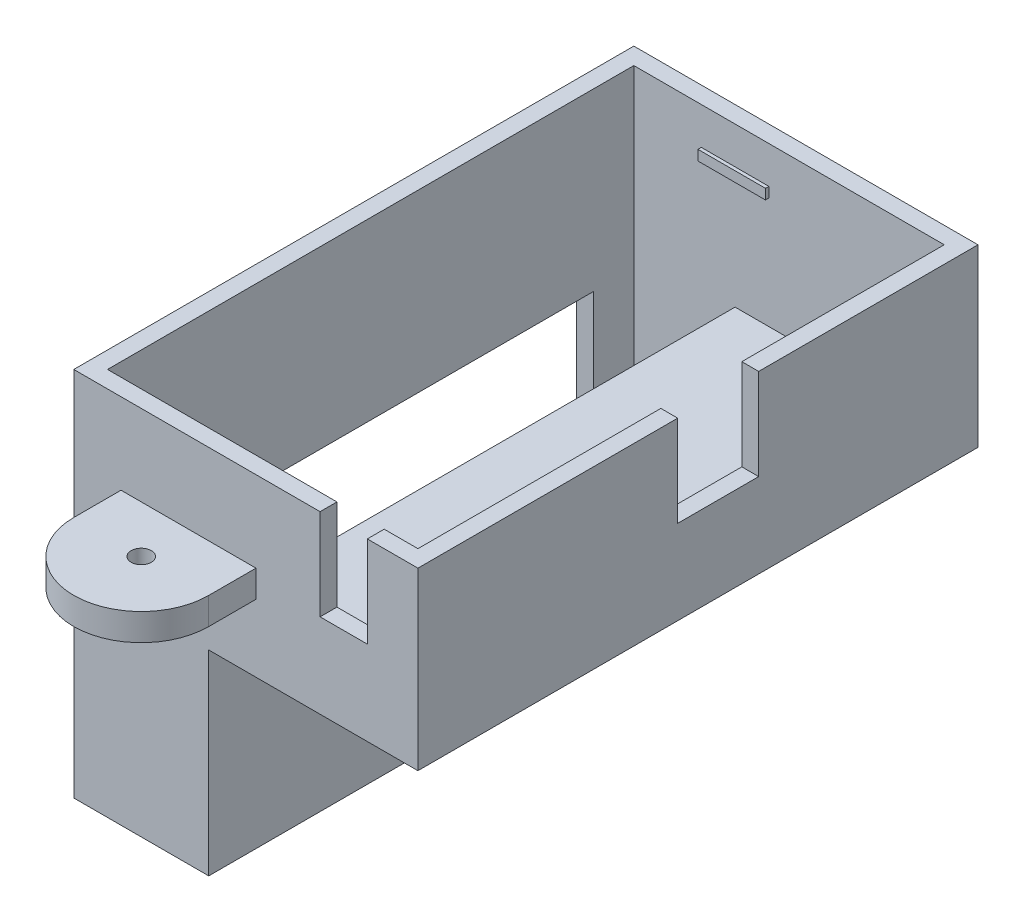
ISO-10303-21;
HEADER;
FILE_DESCRIPTION(('STEP AP214'),'2;1');
FILE_NAME('part.step','',(''),(''),'','','');
FILE_SCHEMA(('AUTOMOTIVE_DESIGN { 1 0 10303 214 1 1 1 1 }'));
ENDSEC;
DATA;
#1=APPLICATION_CONTEXT('core data for automotive mechanical design processes');
#2=APPLICATION_PROTOCOL_DEFINITION('international standard','automotive_design',2000,#1);
#3=PRODUCT_CONTEXT('',#1,'mechanical');
#4=PRODUCT('Part','Part','',(#3));
#5=PRODUCT_RELATED_PRODUCT_CATEGORY('part','',(#4));
#6=PRODUCT_DEFINITION_FORMATION('','',#4);
#7=PRODUCT_DEFINITION_CONTEXT('part definition',#1,'design');
#8=PRODUCT_DEFINITION('design','',#6,#7);
#9=PRODUCT_DEFINITION_SHAPE('','',#8);
#10=(LENGTH_UNIT() NAMED_UNIT(*) SI_UNIT(.MILLI.,.METRE.));
#11=(NAMED_UNIT(*) PLANE_ANGLE_UNIT() SI_UNIT($,.RADIAN.));
#12=(NAMED_UNIT(*) SI_UNIT($,.STERADIAN.) SOLID_ANGLE_UNIT());
#13=UNCERTAINTY_MEASURE_WITH_UNIT(LENGTH_MEASURE(1.E-05),#10,'distance_accuracy_value','');
#14=(GEOMETRIC_REPRESENTATION_CONTEXT(3) GLOBAL_UNCERTAINTY_ASSIGNED_CONTEXT((#13)) GLOBAL_UNIT_ASSIGNED_CONTEXT((#10,
#11,#12)) REPRESENTATION_CONTEXT('',''));
#15=CARTESIAN_POINT('',(0.,0.,0.));
#16=DIRECTION('',(0.,0.,1.));
#17=DIRECTION('',(1.,0.,0.));
#18=AXIS2_PLACEMENT_3D('',#15,#16,#17);
#19=CARTESIAN_POINT('',(-25.5,55.,41.5));
#20=DIRECTION('',(0.,0.,-1.));
#21=DIRECTION('',(-1.,0.,0.));
#22=AXIS2_PLACEMENT_3D('',#19,#20,#21);
#23=PLANE('',#22);
#24=DIRECTION('',(0.,-1.,0.));
#25=VECTOR('',#24,1.);
#26=CARTESIAN_POINT('',(11.,41.5,41.5));
#27=LINE('',#26,#25);
#28=CARTESIAN_POINT('',(11.,55.,41.5));
#29=VERTEX_POINT('',#28);
#30=CARTESIAN_POINT('',(11.,41.5,41.5));
#31=VERTEX_POINT('',#30);
#32=EDGE_CURVE('E390',#29,#31,#27,.T.);
#33=ORIENTED_EDGE('',*,*,#32,.F.);
#34=DIRECTION('',(1.,0.,0.));
#35=VECTOR('',#34,1.);
#36=CARTESIAN_POINT('',(-25.5,55.,41.5));
#37=LINE('',#36,#35);
#38=CARTESIAN_POINT('',(-25.5,55.,41.5));
#39=VERTEX_POINT('',#38);
#40=EDGE_CURVE('E511',#39,#29,#37,.T.);
#41=ORIENTED_EDGE('',*,*,#40,.F.);
#42=DIRECTION('',(0.,-1.,0.));
#43=VECTOR('',#42,1.);
#44=CARTESIAN_POINT('',(-25.5,55.,41.5));
#45=LINE('',#44,#43);
#46=CARTESIAN_POINT('',(-25.5,0.,41.5));
#47=VERTEX_POINT('',#46);
#48=EDGE_CURVE('E12',#39,#47,#45,.T.);
#49=ORIENTED_EDGE('',*,*,#48,.T.);
#50=DIRECTION('',(1.,0.,0.));
#51=VECTOR('',#50,1.);
#52=CARTESIAN_POINT('',(-25.5,0.,41.5));
#53=LINE('',#52,#51);
#54=CARTESIAN_POINT('',(-5.49999999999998,0.,41.5));
#55=VERTEX_POINT('',#54);
#56=EDGE_CURVE('E522',#47,#55,#53,.T.);
#57=ORIENTED_EDGE('',*,*,#56,.T.);
#58=DIRECTION('',(0.,-1.,0.));
#59=VECTOR('',#58,1.);
#60=CARTESIAN_POINT('',(-5.49999999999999,120.100225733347,41.5));
#61=LINE('',#60,#59);
#62=CARTESIAN_POINT('',(-5.49999999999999,29.,41.5));
#63=VERTEX_POINT('',#62);
#64=EDGE_CURVE('E50',#63,#55,#61,.T.);
#65=ORIENTED_EDGE('',*,*,#64,.F.);
#66=DIRECTION('',(-1.,0.,0.));
#67=VECTOR('',#66,1.);
#68=CARTESIAN_POINT('',(-5.49999999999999,29.,41.5));
#69=LINE('',#68,#67);
#70=CARTESIAN_POINT('',(25.5,29.,41.5));
#71=VERTEX_POINT('',#70);
#72=EDGE_CURVE('E309',#71,#63,#69,.T.);
#73=ORIENTED_EDGE('',*,*,#72,.F.);
#74=DIRECTION('',(0.,-1.,0.));
#75=VECTOR('',#74,1.);
#76=CARTESIAN_POINT('',(25.5,55.,41.5));
#77=LINE('',#76,#75);
#78=CARTESIAN_POINT('',(25.5,55.,41.5));
#79=VERTEX_POINT('',#78);
#80=EDGE_CURVE('E43',#79,#71,#77,.T.);
#81=ORIENTED_EDGE('',*,*,#80,.F.);
#82=CARTESIAN_POINT('',(18.,55.,41.5));
#83=VERTEX_POINT('',#82);
#84=EDGE_CURVE('E509',#83,#79,#37,.T.);
#85=ORIENTED_EDGE('',*,*,#84,.F.);
#86=DIRECTION('',(0.,1.,0.));
#87=VECTOR('',#86,1.);
#88=CARTESIAN_POINT('',(18.,41.5,41.5));
#89=LINE('',#88,#87);
#90=CARTESIAN_POINT('',(18.,41.5,41.5));
#91=VERTEX_POINT('',#90);
#92=EDGE_CURVE('E379',#91,#83,#89,.T.);
#93=ORIENTED_EDGE('',*,*,#92,.F.);
#94=DIRECTION('',(1.,0.,0.));
#95=VECTOR('',#94,1.);
#96=CARTESIAN_POINT('',(18.,41.5,41.5));
#97=LINE('',#96,#95);
#98=EDGE_CURVE('E393',#31,#91,#97,.T.);
#99=ORIENTED_EDGE('',*,*,#98,.F.);
#100=EDGE_LOOP('',(#33,#41,#49,#57,#65,#73,#81,#85,#93,#99));
#101=FACE_BOUND('',#100,.T.);
#102=DIRECTION('',(0.,1.,0.));
#103=VECTOR('',#102,1.);
#104=CARTESIAN_POINT('',(1.50000000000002,39.,41.5));
#105=LINE('',#104,#103);
#106=CARTESIAN_POINT('',(1.50000000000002,39.,41.5));
#107=VERTEX_POINT('',#106);
#108=CARTESIAN_POINT('',(1.50000000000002,43.,41.5));
#109=VERTEX_POINT('',#108);
#110=EDGE_CURVE('E284',#107,#109,#105,.T.);
#111=ORIENTED_EDGE('',*,*,#110,.F.);
#112=DIRECTION('',(-1.,0.,0.));
#113=VECTOR('',#112,1.);
#114=CARTESIAN_POINT('',(-18.5,39.,41.5));
#115=LINE('',#114,#113);
#116=CARTESIAN_POINT('',(-18.5,39.,41.5));
#117=VERTEX_POINT('',#116);
#118=EDGE_CURVE('E301',#107,#117,#115,.T.);
#119=ORIENTED_EDGE('',*,*,#118,.T.);
#120=DIRECTION('',(0.,1.,0.));
#121=VECTOR('',#120,1.);
#122=CARTESIAN_POINT('',(-18.5,39.,41.5));
#123=LINE('',#122,#121);
#124=CARTESIAN_POINT('',(-18.5,43.,41.5));
#125=VERTEX_POINT('',#124);
#126=EDGE_CURVE('E285',#117,#125,#123,.T.);
#127=ORIENTED_EDGE('',*,*,#126,.T.);
#128=DIRECTION('',(1.,0.,0.));
#129=VECTOR('',#128,1.);
#130=CARTESIAN_POINT('',(-39.3086520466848,43.,41.5));
#131=LINE('',#130,#129);
#132=EDGE_CURVE('E271',#125,#109,#131,.T.);
#133=ORIENTED_EDGE('',*,*,#132,.T.);
#134=EDGE_LOOP('',(#111,#119,#127,#133));
#135=FACE_BOUND('',#134,.T.);
#136=ADVANCED_FACE('F34',(#101,#135),#23,.F.);
#137=CARTESIAN_POINT('',(-23.,-79.4292137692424,39.));
#138=DIRECTION('',(0.,0.,1.));
#139=DIRECTION('',(1.,0.,0.));
#140=AXIS2_PLACEMENT_3D('',#137,#138,#139);
#141=PLANE('',#140);
#142=DIRECTION('',(-1.,0.,0.));
#143=VECTOR('',#142,1.);
#144=CARTESIAN_POINT('',(18.,41.5,39.));
#145=LINE('',#144,#143);
#146=CARTESIAN_POINT('',(18.,41.5,39.));
#147=VERTEX_POINT('',#146);
#148=CARTESIAN_POINT('',(11.,41.5,39.));
#149=VERTEX_POINT('',#148);
#150=EDGE_CURVE('E382',#147,#149,#145,.T.);
#151=ORIENTED_EDGE('',*,*,#150,.F.);
#152=DIRECTION('',(0.,-1.,0.));
#153=VECTOR('',#152,1.);
#154=CARTESIAN_POINT('',(18.,41.5,39.));
#155=LINE('',#154,#153);
#156=CARTESIAN_POINT('',(18.,55.,39.));
#157=VERTEX_POINT('',#156);
#158=EDGE_CURVE('E386',#157,#147,#155,.T.);
#159=ORIENTED_EDGE('',*,*,#158,.F.);
#160=DIRECTION('',(1.,0.,0.));
#161=VECTOR('',#160,1.);
#162=CARTESIAN_POINT('',(-23.,55.,39.));
#163=LINE('',#162,#161);
#164=CARTESIAN_POINT('',(23.,55.,39.));
#165=VERTEX_POINT('',#164);
#166=EDGE_CURVE('E487',#157,#165,#163,.T.);
#167=ORIENTED_EDGE('',*,*,#166,.T.);
#168=DIRECTION('',(0.,1.,0.));
#169=VECTOR('',#168,1.);
#170=CARTESIAN_POINT('',(23.,-83.9344982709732,39.));
#171=LINE('',#170,#169);
#172=CARTESIAN_POINT('',(23.,31.5,39.));
#173=VERTEX_POINT('',#172);
#174=EDGE_CURVE('E470',#173,#165,#171,.T.);
#175=ORIENTED_EDGE('',*,*,#174,.F.);
#176=DIRECTION('',(-1.,0.,0.));
#177=VECTOR('',#176,1.);
#178=CARTESIAN_POINT('',(-7.99999999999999,31.5,39.));
#179=LINE('',#178,#177);
#180=CARTESIAN_POINT('',(-7.99999999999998,31.5,39.));
#181=VERTEX_POINT('',#180);
#182=EDGE_CURVE('E466',#173,#181,#179,.T.);
#183=ORIENTED_EDGE('',*,*,#182,.T.);
#184=DIRECTION('',(0.,1.,0.));
#185=VECTOR('',#184,1.);
#186=CARTESIAN_POINT('',(-7.99999999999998,-79.4292137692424,39.));
#187=LINE('',#186,#185);
#188=CARTESIAN_POINT('',(-7.99999999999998,2.5,39.));
#189=VERTEX_POINT('',#188);
#190=EDGE_CURVE('E499',#189,#181,#187,.T.);
#191=ORIENTED_EDGE('',*,*,#190,.F.);
#192=DIRECTION('',(-1.,0.,0.));
#193=VECTOR('',#192,1.);
#194=CARTESIAN_POINT('',(-23.,2.5,39.));
#195=LINE('',#194,#193);
#196=CARTESIAN_POINT('',(-23.,2.5,39.));
#197=VERTEX_POINT('',#196);
#198=EDGE_CURVE('E485',#189,#197,#195,.T.);
#199=ORIENTED_EDGE('',*,*,#198,.T.);
#200=DIRECTION('',(0.,1.,0.));
#201=VECTOR('',#200,1.);
#202=CARTESIAN_POINT('',(-23.,-79.4292137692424,39.));
#203=LINE('',#202,#201);
#204=CARTESIAN_POINT('',(-23.,55.,39.));
#205=VERTEX_POINT('',#204);
#206=EDGE_CURVE('E494',#197,#205,#203,.T.);
#207=ORIENTED_EDGE('',*,*,#206,.T.);
#208=CARTESIAN_POINT('',(11.,55.,39.));
#209=VERTEX_POINT('',#208);
#210=EDGE_CURVE('E488',#205,#209,#163,.T.);
#211=ORIENTED_EDGE('',*,*,#210,.T.);
#212=DIRECTION('',(0.,1.,0.));
#213=VECTOR('',#212,1.);
#214=CARTESIAN_POINT('',(11.,41.5,39.));
#215=LINE('',#214,#213);
#216=EDGE_CURVE('E380',#149,#209,#215,.T.);
#217=ORIENTED_EDGE('',*,*,#216,.F.);
#218=EDGE_LOOP('',(#151,#159,#167,#175,#183,#191,#199,#207,#211,#217));
#219=FACE_BOUND('',#218,.T.);
#220=DIRECTION('',(0.,-1.,0.));
#221=VECTOR('',#220,1.);
#222=CARTESIAN_POINT('',(-2.99625899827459,49.5,39.));
#223=LINE('',#222,#221);
#224=CARTESIAN_POINT('',(-2.99625899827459,49.5,39.));
#225=VERTEX_POINT('',#224);
#226=CARTESIAN_POINT('',(-2.99625899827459,48.,39.));
#227=VERTEX_POINT('',#226);
#228=EDGE_CURVE('E316',#225,#227,#223,.T.);
#229=ORIENTED_EDGE('',*,*,#228,.F.);
#230=DIRECTION('',(1.,0.,0.));
#231=VECTOR('',#230,1.);
#232=CARTESIAN_POINT('',(-2.99625899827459,49.5,39.));
#233=LINE('',#232,#231);
#234=CARTESIAN_POINT('',(-12.9962589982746,49.5,39.));
#235=VERTEX_POINT('',#234);
#236=EDGE_CURVE('E321',#235,#225,#233,.T.);
#237=ORIENTED_EDGE('',*,*,#236,.F.);
#238=DIRECTION('',(0.,1.,0.));
#239=VECTOR('',#238,1.);
#240=CARTESIAN_POINT('',(-12.9962589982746,49.5,39.));
#241=LINE('',#240,#239);
#242=CARTESIAN_POINT('',(-12.9962589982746,48.,39.));
#243=VERTEX_POINT('',#242);
#244=EDGE_CURVE('E331',#243,#235,#241,.T.);
#245=ORIENTED_EDGE('',*,*,#244,.F.);
#246=DIRECTION('',(-1.,0.,0.));
#247=VECTOR('',#246,1.);
#248=CARTESIAN_POINT('',(-2.99625899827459,48.,39.));
#249=LINE('',#248,#247);
#250=EDGE_CURVE('E58',#227,#243,#249,.T.);
#251=ORIENTED_EDGE('',*,*,#250,.F.);
#252=EDGE_LOOP('',(#229,#237,#245,#251));
#253=FACE_BOUND('',#252,.T.);
#254=ADVANCED_FACE('F584',(#219,#253),#141,.F.);
#255=CARTESIAN_POINT('',(-23.,-79.4292137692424,-39.));
#256=DIRECTION('',(0.,0.,-1.));
#257=DIRECTION('',(-1.,0.,0.));
#258=AXIS2_PLACEMENT_3D('',#255,#256,#257);
#259=PLANE('',#258);
#260=DIRECTION('',(1.,0.,0.));
#261=VECTOR('',#260,1.);
#262=CARTESIAN_POINT('',(-23.,2.5,-39.));
#263=LINE('',#262,#261);
#264=CARTESIAN_POINT('',(-23.,2.5,-39.));
#265=VERTEX_POINT('',#264);
#266=CARTESIAN_POINT('',(-7.99999999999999,2.5,-39.));
#267=VERTEX_POINT('',#266);
#268=EDGE_CURVE('E480',#265,#267,#263,.T.);
#269=ORIENTED_EDGE('',*,*,#268,.T.);
#270=DIRECTION('',(0.,1.,0.));
#271=VECTOR('',#270,1.);
#272=CARTESIAN_POINT('',(-7.99999999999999,-79.4292137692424,-39.));
#273=LINE('',#272,#271);
#274=CARTESIAN_POINT('',(-7.99999999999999,31.5,-39.));
#275=VERTEX_POINT('',#274);
#276=EDGE_CURVE('E496',#267,#275,#273,.T.);
#277=ORIENTED_EDGE('',*,*,#276,.T.);
#278=DIRECTION('',(1.,0.,0.));
#279=VECTOR('',#278,1.);
#280=CARTESIAN_POINT('',(-7.99999999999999,31.5,-39.));
#281=LINE('',#280,#279);
#282=CARTESIAN_POINT('',(23.,31.5,-39.));
#283=VERTEX_POINT('',#282);
#284=EDGE_CURVE('E460',#275,#283,#281,.T.);
#285=ORIENTED_EDGE('',*,*,#284,.T.);
#286=DIRECTION('',(0.,1.,0.));
#287=VECTOR('',#286,1.);
#288=CARTESIAN_POINT('',(23.,-83.9344982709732,-39.));
#289=LINE('',#288,#287);
#290=CARTESIAN_POINT('',(23.,55.,-39.));
#291=VERTEX_POINT('',#290);
#292=EDGE_CURVE('E461',#283,#291,#289,.T.);
#293=ORIENTED_EDGE('',*,*,#292,.T.);
#294=DIRECTION('',(-1.,0.,0.));
#295=VECTOR('',#294,1.);
#296=CARTESIAN_POINT('',(-23.,55.,-39.));
#297=LINE('',#296,#295);
#298=CARTESIAN_POINT('',(-23.,55.,-39.));
#299=VERTEX_POINT('',#298);
#300=EDGE_CURVE('E491',#291,#299,#297,.T.);
#301=ORIENTED_EDGE('',*,*,#300,.T.);
#302=DIRECTION('',(0.,1.,0.));
#303=VECTOR('',#302,1.);
#304=CARTESIAN_POINT('',(-23.,-79.4292137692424,-39.));
#305=LINE('',#304,#303);
#306=EDGE_CURVE('E481',#265,#299,#305,.T.);
#307=ORIENTED_EDGE('',*,*,#306,.F.);
#308=EDGE_LOOP('',(#269,#277,#285,#293,#301,#307));
#309=FACE_BOUND('',#308,.T.);
#310=DIRECTION('',(0.,-1.,0.));
#311=VECTOR('',#310,1.);
#312=CARTESIAN_POINT('',(-12.9962589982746,49.5,-39.));
#313=LINE('',#312,#311);
#314=CARTESIAN_POINT('',(-12.9962589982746,49.5,-39.));
#315=VERTEX_POINT('',#314);
#316=CARTESIAN_POINT('',(-12.9962589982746,48.,-39.));
#317=VERTEX_POINT('',#316);
#318=EDGE_CURVE('E346',#315,#317,#313,.T.);
#319=ORIENTED_EDGE('',*,*,#318,.F.);
#320=DIRECTION('',(-1.,0.,0.));
#321=VECTOR('',#320,1.);
#322=CARTESIAN_POINT('',(-12.9962589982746,49.5,-39.));
#323=LINE('',#322,#321);
#324=CARTESIAN_POINT('',(-2.99625899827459,49.5,-39.));
#325=VERTEX_POINT('',#324);
#326=EDGE_CURVE('E351',#325,#315,#323,.T.);
#327=ORIENTED_EDGE('',*,*,#326,.F.);
#328=DIRECTION('',(0.,1.,0.));
#329=VECTOR('',#328,1.);
#330=CARTESIAN_POINT('',(-2.99625899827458,49.5,-39.));
#331=LINE('',#330,#329);
#332=CARTESIAN_POINT('',(-2.99625899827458,48.,-39.));
#333=VERTEX_POINT('',#332);
#334=EDGE_CURVE('E363',#333,#325,#331,.T.);
#335=ORIENTED_EDGE('',*,*,#334,.F.);
#336=DIRECTION('',(1.,0.,0.));
#337=VECTOR('',#336,1.);
#338=CARTESIAN_POINT('',(-12.9962589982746,48.,-39.));
#339=LINE('',#338,#337);
#340=EDGE_CURVE('E360',#317,#333,#339,.T.);
#341=ORIENTED_EDGE('',*,*,#340,.F.);
#342=EDGE_LOOP('',(#319,#327,#335,#341));
#343=FACE_BOUND('',#342,.T.);
#344=ADVANCED_FACE('F604',(#309,#343),#259,.F.);
#345=CARTESIAN_POINT('',(0.,55.,0.));
#346=DIRECTION('',(0.,1.,0.));
#347=DIRECTION('',(0.,0.,1.));
#348=AXIS2_PLACEMENT_3D('',#345,#346,#347);
#349=PLANE('',#348);
#350=DIRECTION('',(0.,0.,1.));
#351=VECTOR('',#350,1.);
#352=CARTESIAN_POINT('',(18.,55.,23.7930936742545));
#353=LINE('',#352,#351);
#354=EDGE_CURVE('E396',#157,#83,#353,.T.);
#355=ORIENTED_EDGE('',*,*,#354,.T.);
#356=ORIENTED_EDGE('',*,*,#84,.T.);
#357=DIRECTION('',(0.,0.,-1.));
#358=VECTOR('',#357,1.);
#359=CARTESIAN_POINT('',(25.5,55.,-41.5));
#360=LINE('',#359,#358);
#361=CARTESIAN_POINT('',(25.5,55.,2.99999999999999));
#362=VERTEX_POINT('',#361);
#363=EDGE_CURVE('E514',#79,#362,#360,.T.);
#364=ORIENTED_EDGE('',*,*,#363,.T.);
#365=DIRECTION('',(1.,0.,0.));
#366=VECTOR('',#365,1.);
#367=CARTESIAN_POINT('',(4.93760813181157,55.,3.));
#368=LINE('',#367,#366);
#369=CARTESIAN_POINT('',(23.,55.,3.));
#370=VERTEX_POINT('',#369);
#371=EDGE_CURVE('E409',#370,#362,#368,.T.);
#372=ORIENTED_EDGE('',*,*,#371,.F.);
#373=DIRECTION('',(0.,0.,-1.));
#374=VECTOR('',#373,1.);
#375=CARTESIAN_POINT('',(23.,55.,-39.));
#376=LINE('',#375,#374);
#377=EDGE_CURVE('E467',#165,#370,#376,.T.);
#378=ORIENTED_EDGE('',*,*,#377,.F.);
#379=ORIENTED_EDGE('',*,*,#166,.F.);
#380=EDGE_LOOP('',(#355,#356,#364,#372,#378,#379));
#381=FACE_BOUND('',#380,.T.);
#382=ADVANCED_FACE('F575',(#381),#349,.T.);
#383=CARTESIAN_POINT('',(-7.99999999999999,-79.4292137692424,-39.));
#384=DIRECTION('',(1.,0.,0.));
#385=DIRECTION('',(0.,0.,-1.));
#386=AXIS2_PLACEMENT_3D('',#383,#384,#385);
#387=PLANE('',#386);
#388=DIRECTION('',(0.,0.,-1.));
#389=VECTOR('',#388,1.);
#390=CARTESIAN_POINT('',(-7.99999999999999,31.5,-39.));
#391=LINE('',#390,#389);
#392=EDGE_CURVE('E463',#181,#275,#391,.T.);
#393=ORIENTED_EDGE('',*,*,#392,.T.);
#394=ORIENTED_EDGE('',*,*,#276,.F.);
#395=DIRECTION('',(0.,0.,1.));
#396=VECTOR('',#395,1.);
#397=CARTESIAN_POINT('',(-7.99999999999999,2.5,-39.));
#398=LINE('',#397,#396);
#399=EDGE_CURVE('E478',#267,#189,#398,.T.);
#400=ORIENTED_EDGE('',*,*,#399,.T.);
#401=ORIENTED_EDGE('',*,*,#190,.T.);
#402=EDGE_LOOP('',(#393,#394,#400,#401));
#403=FACE_BOUND('',#402,.T.);
#404=ADVANCED_FACE('F612',(#403),#387,.F.);
#405=CARTESIAN_POINT('',(-25.5,55.,-41.5));
#406=DIRECTION('',(1.,0.,0.));
#407=DIRECTION('',(0.,0.,-1.));
#408=AXIS2_PLACEMENT_3D('',#405,#406,#407);
#409=PLANE('',#408);
#410=DIRECTION('',(0.,0.,-1.));
#411=VECTOR('',#410,1.);
#412=CARTESIAN_POINT('',(-25.5,29.,24.));
#413=LINE('',#412,#411);
#414=CARTESIAN_POINT('',(-25.5,29.,24.));
#415=VERTEX_POINT('',#414);
#416=CARTESIAN_POINT('',(-25.5,29.,-33.));
#417=VERTEX_POINT('',#416);
#418=EDGE_CURVE('E439',#415,#417,#413,.T.);
#419=ORIENTED_EDGE('',*,*,#418,.F.);
#420=DIRECTION('',(0.,1.,0.));
#421=VECTOR('',#420,1.);
#422=CARTESIAN_POINT('',(-25.5,29.,24.));
#423=LINE('',#422,#421);
#424=CARTESIAN_POINT('',(-25.5,10.,24.));
#425=VERTEX_POINT('',#424);
#426=EDGE_CURVE('E428',#425,#415,#423,.T.);
#427=ORIENTED_EDGE('',*,*,#426,.F.);
#428=DIRECTION('',(0.,0.,1.));
#429=VECTOR('',#428,1.);
#430=CARTESIAN_POINT('',(-25.5,10.,24.));
#431=LINE('',#430,#429);
#432=CARTESIAN_POINT('',(-25.5,10.,-33.));
#433=VERTEX_POINT('',#432);
#434=EDGE_CURVE('E445',#433,#425,#431,.T.);
#435=ORIENTED_EDGE('',*,*,#434,.F.);
#436=DIRECTION('',(0.,-1.,0.));
#437=VECTOR('',#436,1.);
#438=CARTESIAN_POINT('',(-25.5,29.,-33.));
#439=LINE('',#438,#437);
#440=EDGE_CURVE('E442',#417,#433,#439,.T.);
#441=ORIENTED_EDGE('',*,*,#440,.F.);
#442=EDGE_LOOP('',(#419,#427,#435,#441));
#443=FACE_BOUND('',#442,.T.);
#444=DIRECTION('',(0.,0.,1.));
#445=VECTOR('',#444,1.);
#446=CARTESIAN_POINT('',(-25.5,0.,-41.5));
#447=LINE('',#446,#445);
#448=CARTESIAN_POINT('',(-25.5,0.,-41.5));
#449=VERTEX_POINT('',#448);
#450=EDGE_CURVE('E505',#449,#47,#447,.T.);
#451=ORIENTED_EDGE('',*,*,#450,.T.);
#452=ORIENTED_EDGE('',*,*,#48,.F.);
#453=DIRECTION('',(0.,0.,1.));
#454=VECTOR('',#453,1.);
#455=CARTESIAN_POINT('',(-25.5,55.,-41.5));
#456=LINE('',#455,#454);
#457=CARTESIAN_POINT('',(-25.5,55.,-41.5));
#458=VERTEX_POINT('',#457);
#459=EDGE_CURVE('E506',#458,#39,#456,.T.);
#460=ORIENTED_EDGE('',*,*,#459,.F.);
#461=DIRECTION('',(0.,-1.,0.));
#462=VECTOR('',#461,1.);
#463=CARTESIAN_POINT('',(-25.5,55.,-41.5));
#464=LINE('',#463,#462);
#465=EDGE_CURVE('E519',#458,#449,#464,.T.);
#466=ORIENTED_EDGE('',*,*,#465,.T.);
#467=EDGE_LOOP('',(#451,#452,#460,#466));
#468=FACE_BOUND('',#467,.T.);
#469=ADVANCED_FACE('F36',(#443,#468),#409,.F.);
#470=CARTESIAN_POINT('',(25.5,55.,-41.5));
#471=DIRECTION('',(-1.,0.,0.));
#472=DIRECTION('',(0.,0.,1.));
#473=AXIS2_PLACEMENT_3D('',#470,#471,#472);
#474=PLANE('',#473);
#475=ORIENTED_EDGE('',*,*,#80,.T.);
#476=DIRECTION('',(0.,0.,1.));
#477=VECTOR('',#476,1.);
#478=CARTESIAN_POINT('',(25.5,29.,41.5));
#479=LINE('',#478,#477);
#480=CARTESIAN_POINT('',(25.5,29.,-41.5));
#481=VERTEX_POINT('',#480);
#482=EDGE_CURVE('E305',#481,#71,#479,.T.);
#483=ORIENTED_EDGE('',*,*,#482,.F.);
#484=DIRECTION('',(0.,-1.,0.));
#485=VECTOR('',#484,1.);
#486=CARTESIAN_POINT('',(25.5,55.,-41.5));
#487=LINE('',#486,#485);
#488=CARTESIAN_POINT('',(25.5,55.,-41.5));
#489=VERTEX_POINT('',#488);
#490=EDGE_CURVE('E528',#489,#481,#487,.T.);
#491=ORIENTED_EDGE('',*,*,#490,.F.);
#492=CARTESIAN_POINT('',(25.5,55.,-9.00000000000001));
#493=VERTEX_POINT('',#492);
#494=EDGE_CURVE('E513',#493,#489,#360,.T.);
#495=ORIENTED_EDGE('',*,*,#494,.F.);
#496=DIRECTION('',(0.,1.,0.));
#497=VECTOR('',#496,1.);
#498=CARTESIAN_POINT('',(25.5,55.,-9.00000000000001));
#499=LINE('',#498,#497);
#500=CARTESIAN_POINT('',(25.5,41.5,-9.00000000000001));
#501=VERTEX_POINT('',#500);
#502=EDGE_CURVE('E417',#501,#493,#499,.T.);
#503=ORIENTED_EDGE('',*,*,#502,.F.);
#504=DIRECTION('',(0.,0.,-1.));
#505=VECTOR('',#504,1.);
#506=CARTESIAN_POINT('',(25.5,41.5,2.99999999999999));
#507=LINE('',#506,#505);
#508=CARTESIAN_POINT('',(25.5,41.5,2.99999999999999));
#509=VERTEX_POINT('',#508);
#510=EDGE_CURVE('E414',#509,#501,#507,.T.);
#511=ORIENTED_EDGE('',*,*,#510,.F.);
#512=DIRECTION('',(0.,-1.,0.));
#513=VECTOR('',#512,1.);
#514=CARTESIAN_POINT('',(25.5,55.,2.99999999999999));
#515=LINE('',#514,#513);
#516=EDGE_CURVE('E388',#362,#509,#515,.T.);
#517=ORIENTED_EDGE('',*,*,#516,.F.);
#518=ORIENTED_EDGE('',*,*,#363,.F.);
#519=EDGE_LOOP('',(#475,#483,#491,#495,#503,#511,#517,#518));
#520=FACE_BOUND('',#519,.T.);
#521=ADVANCED_FACE('F536',(#520),#474,.F.);
#522=CARTESIAN_POINT('',(-25.5,55.,-41.5));
#523=DIRECTION('',(0.,0.,1.));
#524=DIRECTION('',(1.,0.,0.));
#525=AXIS2_PLACEMENT_3D('',#522,#523,#524);
#526=PLANE('',#525);
#527=ORIENTED_EDGE('',*,*,#490,.T.);
#528=DIRECTION('',(1.,0.,0.));
#529=VECTOR('',#528,1.);
#530=CARTESIAN_POINT('',(-5.49999999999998,29.,-41.5));
#531=LINE('',#530,#529);
#532=CARTESIAN_POINT('',(-5.49999999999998,29.,-41.5));
#533=VERTEX_POINT('',#532);
#534=EDGE_CURVE('E303',#533,#481,#531,.T.);
#535=ORIENTED_EDGE('',*,*,#534,.F.);
#536=DIRECTION('',(0.,-1.,0.));
#537=VECTOR('',#536,1.);
#538=CARTESIAN_POINT('',(-5.49999999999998,120.100225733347,-41.5));
#539=LINE('',#538,#537);
#540=CARTESIAN_POINT('',(-5.49999999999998,0.,-41.5));
#541=VERTEX_POINT('',#540);
#542=EDGE_CURVE('E308',#533,#541,#539,.T.);
#543=ORIENTED_EDGE('',*,*,#542,.T.);
#544=DIRECTION('',(-1.,0.,0.));
#545=VECTOR('',#544,1.);
#546=CARTESIAN_POINT('',(-25.5,0.,-41.5));
#547=LINE('',#546,#545);
#548=EDGE_CURVE('E510',#541,#449,#547,.T.);
#549=ORIENTED_EDGE('',*,*,#548,.T.);
#550=ORIENTED_EDGE('',*,*,#465,.F.);
#551=DIRECTION('',(-1.,0.,0.));
#552=VECTOR('',#551,1.);
#553=CARTESIAN_POINT('',(-25.5,55.,-41.5));
#554=LINE('',#553,#552);
#555=EDGE_CURVE('E517',#489,#458,#554,.T.);
#556=ORIENTED_EDGE('',*,*,#555,.F.);
#557=EDGE_LOOP('',(#527,#535,#543,#549,#550,#556));
#558=FACE_BOUND('',#557,.T.);
#559=ADVANCED_FACE('F549',(#558),#526,.F.);
#560=ORIENTED_EDGE('',*,*,#40,.T.);
#561=DIRECTION('',(0.,0.,1.));
#562=VECTOR('',#561,1.);
#563=CARTESIAN_POINT('',(11.,55.,23.7930936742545));
#564=LINE('',#563,#562);
#565=EDGE_CURVE('E400',#209,#29,#564,.T.);
#566=ORIENTED_EDGE('',*,*,#565,.F.);
#567=ORIENTED_EDGE('',*,*,#210,.F.);
#568=DIRECTION('',(0.,0.,1.));
#569=VECTOR('',#568,1.);
#570=CARTESIAN_POINT('',(-23.,55.,-39.));
#571=LINE('',#570,#569);
#572=EDGE_CURVE('E477',#299,#205,#571,.T.);
#573=ORIENTED_EDGE('',*,*,#572,.F.);
#574=ORIENTED_EDGE('',*,*,#300,.F.);
#575=CARTESIAN_POINT('',(23.,55.,-9.00000000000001));
#576=VERTEX_POINT('',#575);
#577=EDGE_CURVE('E457',#576,#291,#376,.T.);
#578=ORIENTED_EDGE('',*,*,#577,.F.);
#579=DIRECTION('',(1.,0.,0.));
#580=VECTOR('',#579,1.);
#581=CARTESIAN_POINT('',(4.93760813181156,55.,-9.));
#582=LINE('',#581,#580);
#583=EDGE_CURVE('E421',#576,#493,#582,.T.);
#584=ORIENTED_EDGE('',*,*,#583,.T.);
#585=ORIENTED_EDGE('',*,*,#494,.T.);
#586=ORIENTED_EDGE('',*,*,#555,.T.);
#587=ORIENTED_EDGE('',*,*,#459,.T.);
#588=EDGE_LOOP('',(#560,#566,#567,#573,#574,#578,#584,#585,#586,#587));
#589=FACE_BOUND('',#588,.T.);
#590=ADVANCED_FACE('F557',(#589),#349,.T.);
#591=CARTESIAN_POINT('',(0.,0.,0.));
#592=DIRECTION('',(0.,1.,0.));
#593=DIRECTION('',(0.,0.,1.));
#594=AXIS2_PLACEMENT_3D('',#591,#592,#593);
#595=PLANE('',#594);
#596=ORIENTED_EDGE('',*,*,#548,.F.);
#597=DIRECTION('',(0.,0.,-1.));
#598=VECTOR('',#597,1.);
#599=CARTESIAN_POINT('',(-5.49999999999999,0.,41.5));
#600=LINE('',#599,#598);
#601=EDGE_CURVE('E293',#55,#541,#600,.T.);
#602=ORIENTED_EDGE('',*,*,#601,.F.);
#603=ORIENTED_EDGE('',*,*,#56,.F.);
#604=ORIENTED_EDGE('',*,*,#450,.F.);
#605=EDGE_LOOP('',(#596,#602,#603,#604));
#606=FACE_BOUND('',#605,.T.);
#607=ADVANCED_FACE('F623',(#606),#595,.F.);
#608=CARTESIAN_POINT('',(-23.,-79.4292137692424,-39.));
#609=DIRECTION('',(-1.,0.,0.));
#610=DIRECTION('',(0.,0.,1.));
#611=AXIS2_PLACEMENT_3D('',#608,#609,#610);
#612=PLANE('',#611);
#613=DIRECTION('',(0.,0.,-1.));
#614=VECTOR('',#613,1.);
#615=CARTESIAN_POINT('',(-23.,10.,24.));
#616=LINE('',#615,#614);
#617=CARTESIAN_POINT('',(-23.,10.,24.));
#618=VERTEX_POINT('',#617);
#619=CARTESIAN_POINT('',(-23.,10.,-33.));
#620=VERTEX_POINT('',#619);
#621=EDGE_CURVE('E432',#618,#620,#616,.T.);
#622=ORIENTED_EDGE('',*,*,#621,.F.);
#623=DIRECTION('',(0.,-1.,0.));
#624=VECTOR('',#623,1.);
#625=CARTESIAN_POINT('',(-23.,29.,24.));
#626=LINE('',#625,#624);
#627=CARTESIAN_POINT('',(-23.,29.,24.));
#628=VERTEX_POINT('',#627);
#629=EDGE_CURVE('E435',#628,#618,#626,.T.);
#630=ORIENTED_EDGE('',*,*,#629,.F.);
#631=DIRECTION('',(0.,0.,1.));
#632=VECTOR('',#631,1.);
#633=CARTESIAN_POINT('',(-23.,29.,24.));
#634=LINE('',#633,#632);
#635=CARTESIAN_POINT('',(-23.,29.,-33.));
#636=VERTEX_POINT('',#635);
#637=EDGE_CURVE('E437',#636,#628,#634,.T.);
#638=ORIENTED_EDGE('',*,*,#637,.F.);
#639=DIRECTION('',(0.,1.,0.));
#640=VECTOR('',#639,1.);
#641=CARTESIAN_POINT('',(-23.,29.,-33.));
#642=LINE('',#641,#640);
#643=EDGE_CURVE('E429',#620,#636,#642,.T.);
#644=ORIENTED_EDGE('',*,*,#643,.F.);
#645=EDGE_LOOP('',(#622,#630,#638,#644));
#646=FACE_BOUND('',#645,.T.);
#647=DIRECTION('',(0.,0.,-1.));
#648=VECTOR('',#647,1.);
#649=CARTESIAN_POINT('',(-23.,2.5,-39.));
#650=LINE('',#649,#648);
#651=EDGE_CURVE('E483',#197,#265,#650,.T.);
#652=ORIENTED_EDGE('',*,*,#651,.T.);
#653=ORIENTED_EDGE('',*,*,#306,.T.);
#654=ORIENTED_EDGE('',*,*,#572,.T.);
#655=ORIENTED_EDGE('',*,*,#206,.F.);
#656=EDGE_LOOP('',(#652,#653,#654,#655));
#657=FACE_BOUND('',#656,.T.);
#658=ADVANCED_FACE('F600',(#646,#657),#612,.F.);
#659=CARTESIAN_POINT('',(0.,2.5,0.));
#660=DIRECTION('',(0.,1.,0.));
#661=DIRECTION('',(0.,0.,1.));
#662=AXIS2_PLACEMENT_3D('',#659,#660,#661);
#663=PLANE('',#662);
#664=ORIENTED_EDGE('',*,*,#651,.F.);
#665=ORIENTED_EDGE('',*,*,#198,.F.);
#666=ORIENTED_EDGE('',*,*,#399,.F.);
#667=ORIENTED_EDGE('',*,*,#268,.F.);
#668=EDGE_LOOP('',(#664,#665,#666,#667));
#669=FACE_BOUND('',#668,.T.);
#670=ADVANCED_FACE('F615',(#669),#663,.T.);
#671=CARTESIAN_POINT('',(23.,-83.9344982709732,-39.));
#672=DIRECTION('',(1.,0.,0.));
#673=DIRECTION('',(0.,0.,-1.));
#674=AXIS2_PLACEMENT_3D('',#671,#672,#673);
#675=PLANE('',#674);
#676=ORIENTED_EDGE('',*,*,#377,.T.);
#677=DIRECTION('',(0.,1.,0.));
#678=VECTOR('',#677,1.);
#679=CARTESIAN_POINT('',(23.,55.,2.99999999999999));
#680=LINE('',#679,#678);
#681=CARTESIAN_POINT('',(23.,41.5,3.));
#682=VERTEX_POINT('',#681);
#683=EDGE_CURVE('E408',#682,#370,#680,.T.);
#684=ORIENTED_EDGE('',*,*,#683,.F.);
#685=DIRECTION('',(0.,0.,1.));
#686=VECTOR('',#685,1.);
#687=CARTESIAN_POINT('',(23.,41.5,2.99999999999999));
#688=LINE('',#687,#686);
#689=CARTESIAN_POINT('',(23.,41.5,-9.00000000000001));
#690=VERTEX_POINT('',#689);
#691=EDGE_CURVE('E411',#690,#682,#688,.T.);
#692=ORIENTED_EDGE('',*,*,#691,.F.);
#693=DIRECTION('',(0.,-1.,0.));
#694=VECTOR('',#693,1.);
#695=CARTESIAN_POINT('',(23.,55.,-9.00000000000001));
#696=LINE('',#695,#694);
#697=EDGE_CURVE('E405',#576,#690,#696,.T.);
#698=ORIENTED_EDGE('',*,*,#697,.F.);
#699=ORIENTED_EDGE('',*,*,#577,.T.);
#700=ORIENTED_EDGE('',*,*,#292,.F.);
#701=DIRECTION('',(0.,0.,1.));
#702=VECTOR('',#701,1.);
#703=CARTESIAN_POINT('',(23.,31.5,-39.));
#704=LINE('',#703,#702);
#705=EDGE_CURVE('E458',#283,#173,#704,.T.);
#706=ORIENTED_EDGE('',*,*,#705,.T.);
#707=ORIENTED_EDGE('',*,*,#174,.T.);
#708=EDGE_LOOP('',(#676,#684,#692,#698,#699,#700,#706,#707));
#709=FACE_BOUND('',#708,.T.);
#710=ADVANCED_FACE('F565',(#709),#675,.F.);
#711=CARTESIAN_POINT('',(0.,31.5,0.));
#712=DIRECTION('',(0.,1.,0.));
#713=DIRECTION('',(0.,0.,1.));
#714=AXIS2_PLACEMENT_3D('',#711,#712,#713);
#715=PLANE('',#714);
#716=ORIENTED_EDGE('',*,*,#392,.F.);
#717=ORIENTED_EDGE('',*,*,#182,.F.);
#718=ORIENTED_EDGE('',*,*,#705,.F.);
#719=ORIENTED_EDGE('',*,*,#284,.F.);
#720=EDGE_LOOP('',(#716,#717,#718,#719));
#721=FACE_BOUND('',#720,.T.);
#722=ADVANCED_FACE('F609',(#721),#715,.T.);
#723=CARTESIAN_POINT('',(37.0832755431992,29.,24.));
#724=DIRECTION('',(0.,0.,1.));
#725=DIRECTION('',(0.,-1.,0.));
#726=AXIS2_PLACEMENT_3D('',#723,#724,#725);
#727=PLANE('',#726);
#728=ORIENTED_EDGE('',*,*,#629,.T.);
#729=DIRECTION('',(-1.,0.,0.));
#730=VECTOR('',#729,1.);
#731=CARTESIAN_POINT('',(37.0832755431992,10.,24.));
#732=LINE('',#731,#730);
#733=EDGE_CURVE('E433',#618,#425,#732,.T.);
#734=ORIENTED_EDGE('',*,*,#733,.T.);
#735=ORIENTED_EDGE('',*,*,#426,.T.);
#736=DIRECTION('',(-1.,0.,0.));
#737=VECTOR('',#736,1.);
#738=CARTESIAN_POINT('',(37.0832755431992,29.,24.));
#739=LINE('',#738,#737);
#740=EDGE_CURVE('E448',#628,#415,#739,.T.);
#741=ORIENTED_EDGE('',*,*,#740,.F.);
#742=EDGE_LOOP('',(#728,#734,#735,#741));
#743=FACE_BOUND('',#742,.T.);
#744=ADVANCED_FACE('F691',(#743),#727,.F.);
#745=CARTESIAN_POINT('',(37.0832755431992,10.,24.));
#746=DIRECTION('',(0.,-1.,0.));
#747=DIRECTION('',(0.,0.,-1.));
#748=AXIS2_PLACEMENT_3D('',#745,#746,#747);
#749=PLANE('',#748);
#750=ORIENTED_EDGE('',*,*,#621,.T.);
#751=DIRECTION('',(-1.,0.,0.));
#752=VECTOR('',#751,1.);
#753=CARTESIAN_POINT('',(37.0832755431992,10.,-33.));
#754=LINE('',#753,#752);
#755=EDGE_CURVE('E450',#620,#433,#754,.T.);
#756=ORIENTED_EDGE('',*,*,#755,.T.);
#757=ORIENTED_EDGE('',*,*,#434,.T.);
#758=ORIENTED_EDGE('',*,*,#733,.F.);
#759=EDGE_LOOP('',(#750,#756,#757,#758));
#760=FACE_BOUND('',#759,.T.);
#761=ADVANCED_FACE('F696',(#760),#749,.F.);
#762=CARTESIAN_POINT('',(37.0832755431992,29.,-33.));
#763=DIRECTION('',(0.,0.,-1.));
#764=DIRECTION('',(0.,1.,0.));
#765=AXIS2_PLACEMENT_3D('',#762,#763,#764);
#766=PLANE('',#765);
#767=ORIENTED_EDGE('',*,*,#643,.T.);
#768=DIRECTION('',(-1.,0.,0.));
#769=VECTOR('',#768,1.);
#770=CARTESIAN_POINT('',(37.0832755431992,29.,-33.));
#771=LINE('',#770,#769);
#772=EDGE_CURVE('E452',#636,#417,#771,.T.);
#773=ORIENTED_EDGE('',*,*,#772,.T.);
#774=ORIENTED_EDGE('',*,*,#440,.T.);
#775=ORIENTED_EDGE('',*,*,#755,.F.);
#776=EDGE_LOOP('',(#767,#773,#774,#775));
#777=FACE_BOUND('',#776,.T.);
#778=ADVANCED_FACE('F708',(#777),#766,.F.);
#779=CARTESIAN_POINT('',(37.0832755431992,29.,24.));
#780=DIRECTION('',(0.,1.,0.));
#781=DIRECTION('',(0.,0.,1.));
#782=AXIS2_PLACEMENT_3D('',#779,#780,#781);
#783=PLANE('',#782);
#784=ORIENTED_EDGE('',*,*,#637,.T.);
#785=ORIENTED_EDGE('',*,*,#740,.T.);
#786=ORIENTED_EDGE('',*,*,#418,.T.);
#787=ORIENTED_EDGE('',*,*,#772,.F.);
#788=EDGE_LOOP('',(#784,#785,#786,#787));
#789=FACE_BOUND('',#788,.T.);
#790=ADVANCED_FACE('F718',(#789),#783,.F.);
#791=CARTESIAN_POINT('',(4.93760813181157,55.,3.));
#792=DIRECTION('',(0.,0.,1.));
#793=DIRECTION('',(1.,0.,0.));
#794=AXIS2_PLACEMENT_3D('',#791,#792,#793);
#795=PLANE('',#794);
#796=ORIENTED_EDGE('',*,*,#683,.T.);
#797=ORIENTED_EDGE('',*,*,#371,.T.);
#798=ORIENTED_EDGE('',*,*,#516,.T.);
#799=DIRECTION('',(1.,0.,0.));
#800=VECTOR('',#799,1.);
#801=CARTESIAN_POINT('',(4.93760813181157,41.5,3.));
#802=LINE('',#801,#800);
#803=EDGE_CURVE('E419',#682,#509,#802,.T.);
#804=ORIENTED_EDGE('',*,*,#803,.F.);
#805=EDGE_LOOP('',(#796,#797,#798,#804));
#806=FACE_BOUND('',#805,.T.);
#807=ADVANCED_FACE('F572',(#806),#795,.F.);
#808=CARTESIAN_POINT('',(4.93760813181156,55.,-9.));
#809=DIRECTION('',(0.,0.,-1.));
#810=DIRECTION('',(0.,1.,0.));
#811=AXIS2_PLACEMENT_3D('',#808,#809,#810);
#812=PLANE('',#811);
#813=ORIENTED_EDGE('',*,*,#697,.T.);
#814=DIRECTION('',(1.,0.,0.));
#815=VECTOR('',#814,1.);
#816=CARTESIAN_POINT('',(4.93760813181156,41.5,-9.));
#817=LINE('',#816,#815);
#818=EDGE_CURVE('E424',#690,#501,#817,.T.);
#819=ORIENTED_EDGE('',*,*,#818,.T.);
#820=ORIENTED_EDGE('',*,*,#502,.T.);
#821=ORIENTED_EDGE('',*,*,#583,.F.);
#822=EDGE_LOOP('',(#813,#819,#820,#821));
#823=FACE_BOUND('',#822,.T.);
#824=ADVANCED_FACE('F562',(#823),#812,.F.);
#825=CARTESIAN_POINT('',(4.93760813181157,41.5,3.));
#826=DIRECTION('',(0.,-1.,0.));
#827=DIRECTION('',(0.,0.,-1.));
#828=AXIS2_PLACEMENT_3D('',#825,#826,#827);
#829=PLANE('',#828);
#830=ORIENTED_EDGE('',*,*,#691,.T.);
#831=ORIENTED_EDGE('',*,*,#803,.T.);
#832=ORIENTED_EDGE('',*,*,#510,.T.);
#833=ORIENTED_EDGE('',*,*,#818,.F.);
#834=EDGE_LOOP('',(#830,#831,#832,#833));
#835=FACE_BOUND('',#834,.T.);
#836=ADVANCED_FACE('F570',(#835),#829,.F.);
#837=CARTESIAN_POINT('',(18.,41.5,23.7930936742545));
#838=DIRECTION('',(1.,0.,0.));
#839=DIRECTION('',(0.,0.,-1.));
#840=AXIS2_PLACEMENT_3D('',#837,#838,#839);
#841=PLANE('',#840);
#842=ORIENTED_EDGE('',*,*,#158,.T.);
#843=DIRECTION('',(0.,0.,1.));
#844=VECTOR('',#843,1.);
#845=CARTESIAN_POINT('',(18.,41.5,23.7930936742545));
#846=LINE('',#845,#844);
#847=EDGE_CURVE('E383',#147,#91,#846,.T.);
#848=ORIENTED_EDGE('',*,*,#847,.T.);
#849=ORIENTED_EDGE('',*,*,#92,.T.);
#850=ORIENTED_EDGE('',*,*,#354,.F.);
#851=EDGE_LOOP('',(#842,#848,#849,#850));
#852=FACE_BOUND('',#851,.T.);
#853=ADVANCED_FACE('F580',(#852),#841,.F.);
#854=CARTESIAN_POINT('',(18.,41.5,23.7930936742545));
#855=DIRECTION('',(0.,-1.,0.));
#856=DIRECTION('',(0.,0.,-1.));
#857=AXIS2_PLACEMENT_3D('',#854,#855,#856);
#858=PLANE('',#857);
#859=ORIENTED_EDGE('',*,*,#150,.T.);
#860=DIRECTION('',(0.,0.,1.));
#861=VECTOR('',#860,1.);
#862=CARTESIAN_POINT('',(11.,41.5,23.7930936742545));
#863=LINE('',#862,#861);
#864=EDGE_CURVE('E398',#149,#31,#863,.T.);
#865=ORIENTED_EDGE('',*,*,#864,.T.);
#866=ORIENTED_EDGE('',*,*,#98,.T.);
#867=ORIENTED_EDGE('',*,*,#847,.F.);
#868=EDGE_LOOP('',(#859,#865,#866,#867));
#869=FACE_BOUND('',#868,.T.);
#870=ADVANCED_FACE('F588',(#869),#858,.F.);
#871=CARTESIAN_POINT('',(11.,41.5,23.7930936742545));
#872=DIRECTION('',(-1.,0.,0.));
#873=DIRECTION('',(0.,-1.,0.));
#874=AXIS2_PLACEMENT_3D('',#871,#872,#873);
#875=PLANE('',#874);
#876=ORIENTED_EDGE('',*,*,#216,.T.);
#877=ORIENTED_EDGE('',*,*,#565,.T.);
#878=ORIENTED_EDGE('',*,*,#32,.T.);
#879=ORIENTED_EDGE('',*,*,#864,.F.);
#880=EDGE_LOOP('',(#876,#877,#878,#879));
#881=FACE_BOUND('',#880,.T.);
#882=ADVANCED_FACE('F591',(#881),#875,.F.);
#883=CARTESIAN_POINT('',(-12.9962589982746,49.5,-38.5));
#884=DIRECTION('',(1.,0.,0.));
#885=DIRECTION('',(0.,0.,-1.));
#886=AXIS2_PLACEMENT_3D('',#883,#884,#885);
#887=PLANE('',#886);
#888=ORIENTED_EDGE('',*,*,#318,.T.);
#889=DIRECTION('',(0.,0.,-1.));
#890=VECTOR('',#889,1.);
#891=CARTESIAN_POINT('',(-12.9962589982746,48.,-38.5));
#892=LINE('',#891,#890);
#893=CARTESIAN_POINT('',(-12.9962589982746,48.,-38.5));
#894=VERTEX_POINT('',#893);
#895=EDGE_CURVE('E376',#894,#317,#892,.T.);
#896=ORIENTED_EDGE('',*,*,#895,.F.);
#897=DIRECTION('',(0.,-1.,0.));
#898=VECTOR('',#897,1.);
#899=CARTESIAN_POINT('',(-12.9962589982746,49.5,-38.5));
#900=LINE('',#899,#898);
#901=CARTESIAN_POINT('',(-12.9962589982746,49.5,-38.5));
#902=VERTEX_POINT('',#901);
#903=EDGE_CURVE('E347',#902,#894,#900,.T.);
#904=ORIENTED_EDGE('',*,*,#903,.F.);
#905=DIRECTION('',(0.,0.,-1.));
#906=VECTOR('',#905,1.);
#907=CARTESIAN_POINT('',(-12.9962589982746,49.5,-38.5));
#908=LINE('',#907,#906);
#909=EDGE_CURVE('E357',#902,#315,#908,.T.);
#910=ORIENTED_EDGE('',*,*,#909,.T.);
#911=EDGE_LOOP('',(#888,#896,#904,#910));
#912=FACE_BOUND('',#911,.T.);
#913=ADVANCED_FACE('F776',(#912),#887,.F.);
#914=CARTESIAN_POINT('',(-12.9962589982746,48.,-38.5));
#915=DIRECTION('',(0.,1.,0.));
#916=DIRECTION('',(0.,0.,1.));
#917=AXIS2_PLACEMENT_3D('',#914,#915,#916);
#918=PLANE('',#917);
#919=ORIENTED_EDGE('',*,*,#340,.T.);
#920=DIRECTION('',(0.,0.,-1.));
#921=VECTOR('',#920,1.);
#922=CARTESIAN_POINT('',(-2.99625899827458,48.,-38.5));
#923=LINE('',#922,#921);
#924=CARTESIAN_POINT('',(-2.99625899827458,48.,-38.5));
#925=VERTEX_POINT('',#924);
#926=EDGE_CURVE('E373',#925,#333,#923,.T.);
#927=ORIENTED_EDGE('',*,*,#926,.F.);
#928=DIRECTION('',(1.,0.,0.));
#929=VECTOR('',#928,1.);
#930=CARTESIAN_POINT('',(-12.9962589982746,48.,-38.5));
#931=LINE('',#930,#929);
#932=EDGE_CURVE('E350',#894,#925,#931,.T.);
#933=ORIENTED_EDGE('',*,*,#932,.F.);
#934=ORIENTED_EDGE('',*,*,#895,.T.);
#935=EDGE_LOOP('',(#919,#927,#933,#934));
#936=FACE_BOUND('',#935,.T.);
#937=ADVANCED_FACE('F783',(#936),#918,.F.);
#938=CARTESIAN_POINT('',(-2.99625899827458,49.5,-38.5));
#939=DIRECTION('',(-1.,0.,0.));
#940=DIRECTION('',(0.,-1.,0.));
#941=AXIS2_PLACEMENT_3D('',#938,#939,#940);
#942=PLANE('',#941);
#943=ORIENTED_EDGE('',*,*,#334,.T.);
#944=DIRECTION('',(0.,0.,-1.));
#945=VECTOR('',#944,1.);
#946=CARTESIAN_POINT('',(-2.99625899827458,49.5,-38.5));
#947=LINE('',#946,#945);
#948=CARTESIAN_POINT('',(-2.99625899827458,49.5,-38.5));
#949=VERTEX_POINT('',#948);
#950=EDGE_CURVE('E370',#949,#325,#947,.T.);
#951=ORIENTED_EDGE('',*,*,#950,.F.);
#952=DIRECTION('',(0.,1.,0.));
#953=VECTOR('',#952,1.);
#954=CARTESIAN_POINT('',(-2.99625899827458,49.5,-38.5));
#955=LINE('',#954,#953);
#956=EDGE_CURVE('E353',#925,#949,#955,.T.);
#957=ORIENTED_EDGE('',*,*,#956,.F.);
#958=ORIENTED_EDGE('',*,*,#926,.T.);
#959=EDGE_LOOP('',(#943,#951,#957,#958));
#960=FACE_BOUND('',#959,.T.);
#961=ADVANCED_FACE('F791',(#960),#942,.F.);
#962=CARTESIAN_POINT('',(-12.9962589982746,49.5,-38.5));
#963=DIRECTION('',(0.,-1.,0.));
#964=DIRECTION('',(0.,0.,-1.));
#965=AXIS2_PLACEMENT_3D('',#962,#963,#964);
#966=PLANE('',#965);
#967=ORIENTED_EDGE('',*,*,#326,.T.);
#968=ORIENTED_EDGE('',*,*,#909,.F.);
#969=DIRECTION('',(-1.,0.,0.));
#970=VECTOR('',#969,1.);
#971=CARTESIAN_POINT('',(-12.9962589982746,49.5,-38.5));
#972=LINE('',#971,#970);
#973=EDGE_CURVE('E355',#949,#902,#972,.T.);
#974=ORIENTED_EDGE('',*,*,#973,.F.);
#975=ORIENTED_EDGE('',*,*,#950,.T.);
#976=EDGE_LOOP('',(#967,#968,#974,#975));
#977=FACE_BOUND('',#976,.T.);
#978=ADVANCED_FACE('F799',(#977),#966,.F.);
#979=CARTESIAN_POINT('',(0.,0.,-38.5));
#980=DIRECTION('',(0.,0.,1.));
#981=DIRECTION('',(1.,0.,0.));
#982=AXIS2_PLACEMENT_3D('',#979,#980,#981);
#983=PLANE('',#982);
#984=ORIENTED_EDGE('',*,*,#903,.T.);
#985=ORIENTED_EDGE('',*,*,#932,.T.);
#986=ORIENTED_EDGE('',*,*,#956,.T.);
#987=ORIENTED_EDGE('',*,*,#973,.T.);
#988=EDGE_LOOP('',(#984,#985,#986,#987));
#989=FACE_BOUND('',#988,.T.);
#990=ADVANCED_FACE('F807',(#989),#983,.T.);
#991=CARTESIAN_POINT('',(-2.99625899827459,49.5,38.5));
#992=DIRECTION('',(-1.,0.,0.));
#993=DIRECTION('',(0.,0.,1.));
#994=AXIS2_PLACEMENT_3D('',#991,#992,#993);
#995=PLANE('',#994);
#996=ORIENTED_EDGE('',*,*,#228,.T.);
#997=DIRECTION('',(0.,0.,1.));
#998=VECTOR('',#997,1.);
#999=CARTESIAN_POINT('',(-2.99625899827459,48.,38.5));
#1000=LINE('',#999,#998);
#1001=CARTESIAN_POINT('',(-2.99625899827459,48.,38.5));
#1002=VERTEX_POINT('',#1001);
#1003=EDGE_CURVE('E344',#1002,#227,#1000,.T.);
#1004=ORIENTED_EDGE('',*,*,#1003,.F.);
#1005=DIRECTION('',(0.,-1.,0.));
#1006=VECTOR('',#1005,1.);
#1007=CARTESIAN_POINT('',(-2.99625899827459,49.5,38.5));
#1008=LINE('',#1007,#1006);
#1009=CARTESIAN_POINT('',(-2.99625899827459,49.5,38.5));
#1010=VERTEX_POINT('',#1009);
#1011=EDGE_CURVE('E317',#1010,#1002,#1008,.T.);
#1012=ORIENTED_EDGE('',*,*,#1011,.F.);
#1013=DIRECTION('',(0.,0.,1.));
#1014=VECTOR('',#1013,1.);
#1015=CARTESIAN_POINT('',(-2.99625899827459,49.5,38.5));
#1016=LINE('',#1015,#1014);
#1017=EDGE_CURVE('E327',#1010,#225,#1016,.T.);
#1018=ORIENTED_EDGE('',*,*,#1017,.T.);
#1019=EDGE_LOOP('',(#996,#1004,#1012,#1018));
#1020=FACE_BOUND('',#1019,.T.);
#1021=ADVANCED_FACE('F815',(#1020),#995,.F.);
#1022=CARTESIAN_POINT('',(-2.99625899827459,48.,38.5));
#1023=DIRECTION('',(0.,1.,0.));
#1024=DIRECTION('',(0.,0.,1.));
#1025=AXIS2_PLACEMENT_3D('',#1022,#1023,#1024);
#1026=PLANE('',#1025);
#1027=ORIENTED_EDGE('',*,*,#250,.T.);
#1028=DIRECTION('',(0.,0.,1.));
#1029=VECTOR('',#1028,1.);
#1030=CARTESIAN_POINT('',(-12.9962589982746,48.,38.5));
#1031=LINE('',#1030,#1029);
#1032=CARTESIAN_POINT('',(-12.9962589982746,48.,38.5));
#1033=VERTEX_POINT('',#1032);
#1034=EDGE_CURVE('E341',#1033,#243,#1031,.T.);
#1035=ORIENTED_EDGE('',*,*,#1034,.F.);
#1036=DIRECTION('',(-1.,0.,0.));
#1037=VECTOR('',#1036,1.);
#1038=CARTESIAN_POINT('',(-2.99625899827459,48.,38.5));
#1039=LINE('',#1038,#1037);
#1040=EDGE_CURVE('E320',#1002,#1033,#1039,.T.);
#1041=ORIENTED_EDGE('',*,*,#1040,.F.);
#1042=ORIENTED_EDGE('',*,*,#1003,.T.);
#1043=EDGE_LOOP('',(#1027,#1035,#1041,#1042));
#1044=FACE_BOUND('',#1043,.T.);
#1045=ADVANCED_FACE('F824',(#1044),#1026,.F.);
#1046=CARTESIAN_POINT('',(-12.9962589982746,49.5,38.5));
#1047=DIRECTION('',(1.,0.,0.));
#1048=DIRECTION('',(0.,0.,-1.));
#1049=AXIS2_PLACEMENT_3D('',#1046,#1047,#1048);
#1050=PLANE('',#1049);
#1051=ORIENTED_EDGE('',*,*,#244,.T.);
#1052=DIRECTION('',(0.,0.,1.));
#1053=VECTOR('',#1052,1.);
#1054=CARTESIAN_POINT('',(-12.9962589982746,49.5,38.5));
#1055=LINE('',#1054,#1053);
#1056=CARTESIAN_POINT('',(-12.9962589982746,49.5,38.5));
#1057=VERTEX_POINT('',#1056);
#1058=EDGE_CURVE('E338',#1057,#235,#1055,.T.);
#1059=ORIENTED_EDGE('',*,*,#1058,.F.);
#1060=DIRECTION('',(0.,1.,0.));
#1061=VECTOR('',#1060,1.);
#1062=CARTESIAN_POINT('',(-12.9962589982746,49.5,38.5));
#1063=LINE('',#1062,#1061);
#1064=EDGE_CURVE('E323',#1033,#1057,#1063,.T.);
#1065=ORIENTED_EDGE('',*,*,#1064,.F.);
#1066=ORIENTED_EDGE('',*,*,#1034,.T.);
#1067=EDGE_LOOP('',(#1051,#1059,#1065,#1066));
#1068=FACE_BOUND('',#1067,.T.);
#1069=ADVANCED_FACE('F832',(#1068),#1050,.F.);
#1070=CARTESIAN_POINT('',(-2.99625899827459,49.5,38.5));
#1071=DIRECTION('',(0.,-1.,0.));
#1072=DIRECTION('',(0.,0.,-1.));
#1073=AXIS2_PLACEMENT_3D('',#1070,#1071,#1072);
#1074=PLANE('',#1073);
#1075=ORIENTED_EDGE('',*,*,#236,.T.);
#1076=ORIENTED_EDGE('',*,*,#1017,.F.);
#1077=DIRECTION('',(1.,0.,0.));
#1078=VECTOR('',#1077,1.);
#1079=CARTESIAN_POINT('',(-2.99625899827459,49.5,38.5));
#1080=LINE('',#1079,#1078);
#1081=EDGE_CURVE('E325',#1057,#1010,#1080,.T.);
#1082=ORIENTED_EDGE('',*,*,#1081,.F.);
#1083=ORIENTED_EDGE('',*,*,#1058,.T.);
#1084=EDGE_LOOP('',(#1075,#1076,#1082,#1083));
#1085=FACE_BOUND('',#1084,.T.);
#1086=ADVANCED_FACE('F840',(#1085),#1074,.F.);
#1087=CARTESIAN_POINT('',(0.,0.,38.5));
#1088=DIRECTION('',(0.,0.,-1.));
#1089=DIRECTION('',(-1.,0.,0.));
#1090=AXIS2_PLACEMENT_3D('',#1087,#1088,#1089);
#1091=PLANE('',#1090);
#1092=ORIENTED_EDGE('',*,*,#1011,.T.);
#1093=ORIENTED_EDGE('',*,*,#1040,.T.);
#1094=ORIENTED_EDGE('',*,*,#1064,.T.);
#1095=ORIENTED_EDGE('',*,*,#1081,.T.);
#1096=EDGE_LOOP('',(#1092,#1093,#1094,#1095));
#1097=FACE_BOUND('',#1096,.T.);
#1098=ADVANCED_FACE('F848',(#1097),#1091,.T.);
#1099=CARTESIAN_POINT('',(0.,29.,0.));
#1100=DIRECTION('',(0.,1.,0.));
#1101=DIRECTION('',(0.,0.,1.));
#1102=AXIS2_PLACEMENT_3D('',#1099,#1100,#1101);
#1103=PLANE('',#1102);
#1104=DIRECTION('',(0.,0.,-1.));
#1105=VECTOR('',#1104,1.);
#1106=CARTESIAN_POINT('',(-5.49999999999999,29.,41.5));
#1107=LINE('',#1106,#1105);
#1108=EDGE_CURVE('E306',#63,#533,#1107,.T.);
#1109=ORIENTED_EDGE('',*,*,#1108,.T.);
#1110=ORIENTED_EDGE('',*,*,#534,.T.);
#1111=ORIENTED_EDGE('',*,*,#482,.T.);
#1112=ORIENTED_EDGE('',*,*,#72,.T.);
#1113=EDGE_LOOP('',(#1109,#1110,#1111,#1112));
#1114=FACE_BOUND('',#1113,.T.);
#1115=ADVANCED_FACE('F545',(#1114),#1103,.F.);
#1116=CARTESIAN_POINT('',(-5.49999999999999,120.100225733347,41.5));
#1117=DIRECTION('',(-1.,0.,0.));
#1118=DIRECTION('',(0.,0.,1.));
#1119=AXIS2_PLACEMENT_3D('',#1116,#1117,#1118);
#1120=PLANE('',#1119);
#1121=ORIENTED_EDGE('',*,*,#64,.T.);
#1122=ORIENTED_EDGE('',*,*,#601,.T.);
#1123=ORIENTED_EDGE('',*,*,#542,.F.);
#1124=ORIENTED_EDGE('',*,*,#1108,.F.);
#1125=EDGE_LOOP('',(#1121,#1122,#1123,#1124));
#1126=FACE_BOUND('',#1125,.T.);
#1127=ADVANCED_FACE('F861',(#1126),#1120,.F.);
#1128=CARTESIAN_POINT('',(-18.5,39.,41.5));
#1129=DIRECTION('',(-1.,0.,0.));
#1130=DIRECTION('',(0.,0.,1.));
#1131=AXIS2_PLACEMENT_3D('',#1128,#1129,#1130);
#1132=PLANE('',#1131);
#1133=DIRECTION('',(0.,0.,-1.));
#1134=VECTOR('',#1133,1.);
#1135=CARTESIAN_POINT('',(-18.5,43.,41.5));
#1136=LINE('',#1135,#1134);
#1137=CARTESIAN_POINT('',(-18.5,43.,48.5));
#1138=VERTEX_POINT('',#1137);
#1139=EDGE_CURVE('E278',#1138,#125,#1136,.T.);
#1140=ORIENTED_EDGE('',*,*,#1139,.T.);
#1141=ORIENTED_EDGE('',*,*,#126,.F.);
#1142=DIRECTION('',(0.,0.,1.));
#1143=VECTOR('',#1142,1.);
#1144=CARTESIAN_POINT('',(-18.5,39.,41.5));
#1145=LINE('',#1144,#1143);
#1146=CARTESIAN_POINT('',(-18.5,39.,48.5));
#1147=VERTEX_POINT('',#1146);
#1148=EDGE_CURVE('E1003',#117,#1147,#1145,.T.);
#1149=ORIENTED_EDGE('',*,*,#1148,.T.);
#1150=DIRECTION('',(0.,1.,0.));
#1151=VECTOR('',#1150,1.);
#1152=CARTESIAN_POINT('',(-18.5,39.,48.5));
#1153=LINE('',#1152,#1151);
#1154=EDGE_CURVE('E295',#1147,#1138,#1153,.T.);
#1155=ORIENTED_EDGE('',*,*,#1154,.T.);
#1156=EDGE_LOOP('',(#1140,#1141,#1149,#1155));
#1157=FACE_BOUND('',#1156,.T.);
#1158=ADVANCED_FACE('F868',(#1157),#1132,.T.);
#1159=CARTESIAN_POINT('',(1.50000000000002,39.,41.5));
#1160=DIRECTION('',(1.,0.,0.));
#1161=DIRECTION('',(0.,0.,-1.));
#1162=AXIS2_PLACEMENT_3D('',#1159,#1160,#1161);
#1163=PLANE('',#1162);
#1164=DIRECTION('',(0.,0.,-1.));
#1165=VECTOR('',#1164,1.);
#1166=CARTESIAN_POINT('',(1.50000000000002,43.,41.5));
#1167=LINE('',#1166,#1165);
#1168=CARTESIAN_POINT('',(1.50000000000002,43.,48.5));
#1169=VERTEX_POINT('',#1168);
#1170=EDGE_CURVE('E267',#1169,#109,#1167,.T.);
#1171=ORIENTED_EDGE('',*,*,#1170,.F.);
#1172=DIRECTION('',(0.,1.,0.));
#1173=VECTOR('',#1172,1.);
#1174=CARTESIAN_POINT('',(1.50000000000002,39.,48.5));
#1175=LINE('',#1174,#1173);
#1176=CARTESIAN_POINT('',(1.50000000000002,39.,48.5));
#1177=VERTEX_POINT('',#1176);
#1178=EDGE_CURVE('E291',#1177,#1169,#1175,.T.);
#1179=ORIENTED_EDGE('',*,*,#1178,.F.);
#1180=DIRECTION('',(0.,0.,-1.));
#1181=VECTOR('',#1180,1.);
#1182=CARTESIAN_POINT('',(1.50000000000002,39.,41.5));
#1183=LINE('',#1182,#1181);
#1184=EDGE_CURVE('E289',#1177,#107,#1183,.T.);
#1185=ORIENTED_EDGE('',*,*,#1184,.T.);
#1186=ORIENTED_EDGE('',*,*,#110,.T.);
#1187=EDGE_LOOP('',(#1171,#1179,#1185,#1186));
#1188=FACE_BOUND('',#1187,.T.);
#1189=ADVANCED_FACE('F287',(#1188),#1163,.T.);
#1190=CARTESIAN_POINT('',(-8.49999999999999,39.,48.5));
#1191=DIRECTION('',(0.,1.,0.));
#1192=DIRECTION('',(0.,0.,1.));
#1193=AXIS2_PLACEMENT_3D('',#1190,#1191,#1192);
#1194=CYLINDRICAL_SURFACE('',#1193,10.);
#1195=CARTESIAN_POINT('',(-8.49999999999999,43.,48.5));
#1196=DIRECTION('',(0.,-1.,0.));
#1197=DIRECTION('',(0.,0.,-1.));
#1198=AXIS2_PLACEMENT_3D('',#1195,#1196,#1197);
#1199=CIRCLE('',#1198,10.);
#1200=EDGE_CURVE('E274',#1138,#1169,#1199,.F.);
#1201=ORIENTED_EDGE('',*,*,#1200,.F.);
#1202=ORIENTED_EDGE('',*,*,#1154,.F.);
#1203=CARTESIAN_POINT('',(-8.49999999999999,39.,48.5));
#1204=DIRECTION('',(0.,1.,0.));
#1205=DIRECTION('',(0.,0.,1.));
#1206=AXIS2_PLACEMENT_3D('',#1203,#1204,#1205);
#1207=CIRCLE('',#1206,10.);
#1208=EDGE_CURVE('E1006',#1147,#1177,#1207,.T.);
#1209=ORIENTED_EDGE('',*,*,#1208,.T.);
#1210=ORIENTED_EDGE('',*,*,#1178,.T.);
#1211=EDGE_LOOP('',(#1201,#1202,#1209,#1210));
#1212=FACE_BOUND('',#1211,.T.);
#1213=ADVANCED_FACE('F882',(#1212),#1194,.T.);
#1214=CARTESIAN_POINT('',(-8.49999999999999,39.,48.5));
#1215=DIRECTION('',(0.,1.,0.));
#1216=DIRECTION('',(0.,0.,1.));
#1217=AXIS2_PLACEMENT_3D('',#1214,#1215,#1216);
#1218=PLANE('',#1217);
#1219=CARTESIAN_POINT('',(-8.49999999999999,39.,48.5));
#1220=DIRECTION('',(0.,1.,0.));
#1221=DIRECTION('',(0.,0.,1.));
#1222=AXIS2_PLACEMENT_3D('',#1219,#1220,#1221);
#1223=CIRCLE('',#1222,1.5);
#1224=CARTESIAN_POINT('',(-8.49999999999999,39.,50.));
#1225=VERTEX_POINT('',#1224);
#1226=EDGE_CURVE('E1002',#1225,#1225,#1223,.T.);
#1227=ORIENTED_EDGE('',*,*,#1226,.T.);
#1228=EDGE_LOOP('',(#1227));
#1229=FACE_BOUND('',#1228,.T.);
#1230=ORIENTED_EDGE('',*,*,#1148,.F.);
#1231=ORIENTED_EDGE('',*,*,#118,.F.);
#1232=ORIENTED_EDGE('',*,*,#1184,.F.);
#1233=ORIENTED_EDGE('',*,*,#1208,.F.);
#1234=EDGE_LOOP('',(#1230,#1231,#1232,#1233));
#1235=FACE_BOUND('',#1234,.T.);
#1236=ADVANCED_FACE('F889',(#1229,#1235),#1218,.F.);
#1237=CARTESIAN_POINT('',(-8.49999999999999,39.,48.5));
#1238=DIRECTION('',(0.,1.,0.));
#1239=DIRECTION('',(0.,0.,1.));
#1240=AXIS2_PLACEMENT_3D('',#1237,#1238,#1239);
#1241=CYLINDRICAL_SURFACE('',#1240,1.5);
#1242=CARTESIAN_POINT('',(-8.49999999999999,43.,48.5));
#1243=DIRECTION('',(0.,-1.,0.));
#1244=DIRECTION('',(0.,0.,-1.));
#1245=AXIS2_PLACEMENT_3D('',#1242,#1243,#1244);
#1246=CIRCLE('',#1245,1.5);
#1247=CARTESIAN_POINT('',(-8.49999999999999,43.,47.));
#1248=VERTEX_POINT('',#1247);
#1249=EDGE_CURVE('E38',#1248,#1248,#1246,.F.);
#1250=ORIENTED_EDGE('',*,*,#1249,.T.);
#1251=EDGE_LOOP('',(#1250));
#1252=FACE_BOUND('',#1251,.T.);
#1253=ORIENTED_EDGE('',*,*,#1226,.F.);
#1254=EDGE_LOOP('',(#1253));
#1255=FACE_BOUND('',#1254,.T.);
#1256=ADVANCED_FACE('F897',(#1252,#1255),#1241,.F.);
#1257=CARTESIAN_POINT('',(-39.3086520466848,43.,41.5));
#1258=DIRECTION('',(0.,-1.,0.));
#1259=DIRECTION('',(0.,0.,-1.));
#1260=AXIS2_PLACEMENT_3D('',#1257,#1258,#1259);
#1261=PLANE('',#1260);
#1262=ORIENTED_EDGE('',*,*,#1200,.T.);
#1263=ORIENTED_EDGE('',*,*,#1170,.T.);
#1264=ORIENTED_EDGE('',*,*,#132,.F.);
#1265=ORIENTED_EDGE('',*,*,#1139,.F.);
#1266=EDGE_LOOP('',(#1262,#1263,#1264,#1265));
#1267=FACE_BOUND('',#1266,.T.);
#1268=ORIENTED_EDGE('',*,*,#1249,.F.);
#1269=EDGE_LOOP('',(#1268));
#1270=FACE_BOUND('',#1269,.T.);
#1271=ADVANCED_FACE('F269',(#1267,#1270),#1261,.F.);
#1272=CLOSED_SHELL('',(#136,#254,#344,#382,#404,#469,#521,#559,#590,#607,#658,#670,#710,#722,
#744,#761,#778,#790,#807,#824,#836,#853,#870,#882,#913,#937,#961,#978,#990,#1021,#1045,#1069,
#1086,#1098,#1115,#1127,#1158,#1189,#1213,#1236,#1256,#1271));
#1273=MANIFOLD_SOLID_BREP('B2',#1272);
#1274=ADVANCED_BREP_SHAPE_REPRESENTATION('',(#18,#1273),#14);
#1275=SHAPE_DEFINITION_REPRESENTATION(#9,#1274);
ENDSEC;
END-ISO-10303-21;
